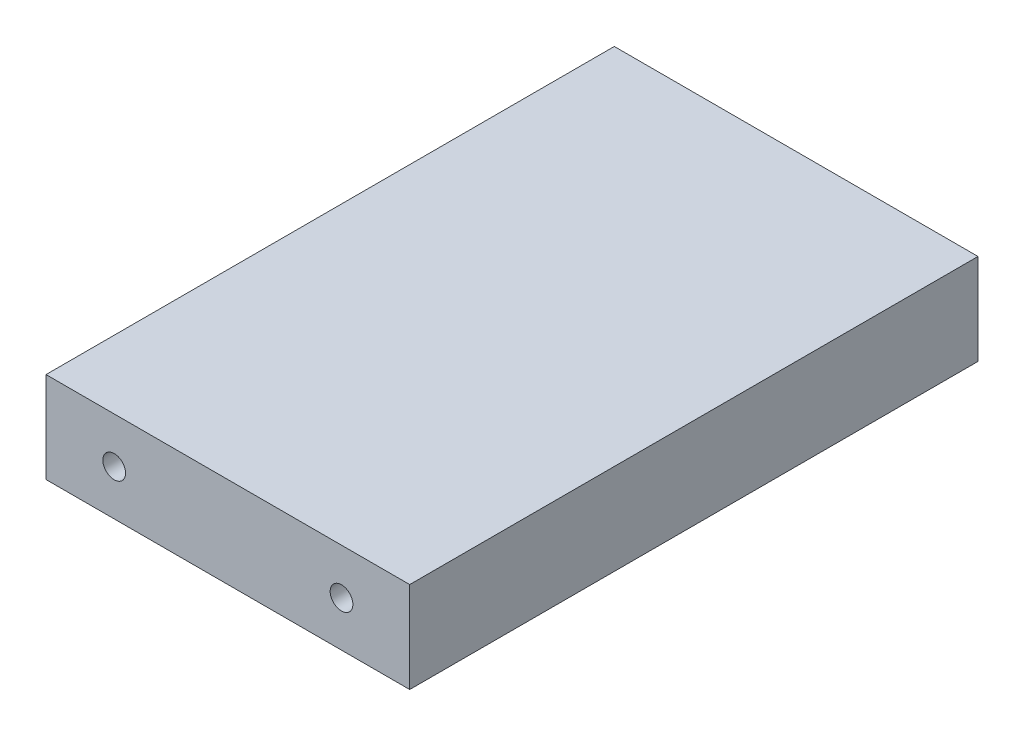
ISO-10303-21;
HEADER;
FILE_DESCRIPTION(('STEP AP214'),'2;1');
FILE_NAME('part.step','',(''),(''),'','','');
FILE_SCHEMA(('AUTOMOTIVE_DESIGN { 1 0 10303 214 1 1 1 1 }'));
ENDSEC;
DATA;
#1=APPLICATION_CONTEXT('core data for automotive mechanical design processes');
#2=APPLICATION_PROTOCOL_DEFINITION('international standard','automotive_design',2000,#1);
#3=PRODUCT_CONTEXT('',#1,'mechanical');
#4=PRODUCT('Part','Part','',(#3));
#5=PRODUCT_RELATED_PRODUCT_CATEGORY('part','',(#4));
#6=PRODUCT_DEFINITION_FORMATION('','',#4);
#7=PRODUCT_DEFINITION_CONTEXT('part definition',#1,'design');
#8=PRODUCT_DEFINITION('design','',#6,#7);
#9=PRODUCT_DEFINITION_SHAPE('','',#8);
#10=(LENGTH_UNIT() NAMED_UNIT(*) SI_UNIT(.MILLI.,.METRE.));
#11=(NAMED_UNIT(*) PLANE_ANGLE_UNIT() SI_UNIT($,.RADIAN.));
#12=(NAMED_UNIT(*) SI_UNIT($,.STERADIAN.) SOLID_ANGLE_UNIT());
#13=UNCERTAINTY_MEASURE_WITH_UNIT(LENGTH_MEASURE(1.E-05),#10,'distance_accuracy_value','');
#14=(GEOMETRIC_REPRESENTATION_CONTEXT(3) GLOBAL_UNCERTAINTY_ASSIGNED_CONTEXT((#13)) GLOBAL_UNIT_ASSIGNED_CONTEXT((#10,
#11,#12)) REPRESENTATION_CONTEXT('',''));
#15=CARTESIAN_POINT('',(0.,0.,0.));
#16=DIRECTION('',(0.,0.,1.));
#17=DIRECTION('',(1.,0.,0.));
#18=AXIS2_PLACEMENT_3D('',#15,#16,#17);
#19=CARTESIAN_POINT('',(0.,0.,125.));
#20=DIRECTION('',(-1.,0.,0.));
#21=DIRECTION('',(0.,0.,1.));
#22=AXIS2_PLACEMENT_3D('',#19,#20,#21);
#23=PLANE('',#22);
#24=DIRECTION('',(0.,1.,0.));
#25=VECTOR('',#24,1.);
#26=CARTESIAN_POINT('',(0.,0.,0.));
#27=LINE('',#26,#25);
#28=CARTESIAN_POINT('',(0.,0.,0.));
#29=VERTEX_POINT('',#28);
#30=CARTESIAN_POINT('',(0.,20.,0.));
#31=VERTEX_POINT('',#30);
#32=EDGE_CURVE('E114',#29,#31,#27,.T.);
#33=ORIENTED_EDGE('',*,*,#32,.T.);
#34=DIRECTION('',(0.,0.,-1.));
#35=VECTOR('',#34,1.);
#36=CARTESIAN_POINT('',(0.,20.,125.));
#37=LINE('',#36,#35);
#38=CARTESIAN_POINT('',(0.,20.,125.));
#39=VERTEX_POINT('',#38);
#40=EDGE_CURVE('E11',#39,#31,#37,.T.);
#41=ORIENTED_EDGE('',*,*,#40,.F.);
#42=DIRECTION('',(0.,1.,0.));
#43=VECTOR('',#42,1.);
#44=CARTESIAN_POINT('',(0.,0.,125.));
#45=LINE('',#44,#43);
#46=CARTESIAN_POINT('',(0.,0.,125.));
#47=VERTEX_POINT('',#46);
#48=EDGE_CURVE('E115',#47,#39,#45,.T.);
#49=ORIENTED_EDGE('',*,*,#48,.F.);
#50=DIRECTION('',(0.,0.,-1.));
#51=VECTOR('',#50,1.);
#52=CARTESIAN_POINT('',(0.,0.,125.));
#53=LINE('',#52,#51);
#54=EDGE_CURVE('E121',#47,#29,#53,.T.);
#55=ORIENTED_EDGE('',*,*,#54,.T.);
#56=EDGE_LOOP('',(#33,#41,#49,#55));
#57=FACE_BOUND('',#56,.T.);
#58=ADVANCED_FACE('F39',(#57),#23,.F.);
#59=CARTESIAN_POINT('',(0.,20.,125.));
#60=DIRECTION('',(0.,-1.,0.));
#61=DIRECTION('',(1.,0.,0.));
#62=AXIS2_PLACEMENT_3D('',#59,#60,#61);
#63=PLANE('',#62);
#64=DIRECTION('',(-1.,0.,0.));
#65=VECTOR('',#64,1.);
#66=CARTESIAN_POINT('',(0.,20.,0.));
#67=LINE('',#66,#65);
#68=CARTESIAN_POINT('',(-80.,20.,0.));
#69=VERTEX_POINT('',#68);
#70=EDGE_CURVE('E124',#31,#69,#67,.T.);
#71=ORIENTED_EDGE('',*,*,#70,.T.);
#72=DIRECTION('',(0.,0.,-1.));
#73=VECTOR('',#72,1.);
#74=CARTESIAN_POINT('',(-80.,20.,125.));
#75=LINE('',#74,#73);
#76=CARTESIAN_POINT('',(-80.,20.,125.));
#77=VERTEX_POINT('',#76);
#78=EDGE_CURVE('E47',#77,#69,#75,.T.);
#79=ORIENTED_EDGE('',*,*,#78,.F.);
#80=DIRECTION('',(-1.,0.,0.));
#81=VECTOR('',#80,1.);
#82=CARTESIAN_POINT('',(0.,20.,125.));
#83=LINE('',#82,#81);
#84=EDGE_CURVE('E86',#39,#77,#83,.T.);
#85=ORIENTED_EDGE('',*,*,#84,.F.);
#86=ORIENTED_EDGE('',*,*,#40,.T.);
#87=EDGE_LOOP('',(#71,#79,#85,#86));
#88=FACE_BOUND('',#87,.T.);
#89=ADVANCED_FACE('F148',(#88),#63,.F.);
#90=CARTESIAN_POINT('',(-80.,0.,125.));
#91=DIRECTION('',(1.,0.,0.));
#92=DIRECTION('',(0.,0.,-1.));
#93=AXIS2_PLACEMENT_3D('',#90,#91,#92);
#94=PLANE('',#93);
#95=DIRECTION('',(0.,-1.,0.));
#96=VECTOR('',#95,1.);
#97=CARTESIAN_POINT('',(-80.,0.,0.));
#98=LINE('',#97,#96);
#99=CARTESIAN_POINT('',(-80.,0.,0.));
#100=VERTEX_POINT('',#99);
#101=EDGE_CURVE('E73',#69,#100,#98,.T.);
#102=ORIENTED_EDGE('',*,*,#101,.T.);
#103=DIRECTION('',(0.,0.,-1.));
#104=VECTOR('',#103,1.);
#105=CARTESIAN_POINT('',(-80.,0.,125.));
#106=LINE('',#105,#104);
#107=CARTESIAN_POINT('',(-80.,0.,125.));
#108=VERTEX_POINT('',#107);
#109=EDGE_CURVE('E129',#108,#100,#106,.T.);
#110=ORIENTED_EDGE('',*,*,#109,.F.);
#111=DIRECTION('',(0.,-1.,0.));
#112=VECTOR('',#111,1.);
#113=CARTESIAN_POINT('',(-80.,0.,125.));
#114=LINE('',#113,#112);
#115=EDGE_CURVE('E118',#77,#108,#114,.T.);
#116=ORIENTED_EDGE('',*,*,#115,.F.);
#117=ORIENTED_EDGE('',*,*,#78,.T.);
#118=EDGE_LOOP('',(#102,#110,#116,#117));
#119=FACE_BOUND('',#118,.T.);
#120=ADVANCED_FACE('F131',(#119),#94,.F.);
#121=CARTESIAN_POINT('',(0.,0.,125.));
#122=DIRECTION('',(0.,1.,0.));
#123=DIRECTION('',(-1.,0.,0.));
#124=AXIS2_PLACEMENT_3D('',#121,#122,#123);
#125=PLANE('',#124);
#126=DIRECTION('',(1.,0.,0.));
#127=VECTOR('',#126,1.);
#128=CARTESIAN_POINT('',(0.,0.,0.));
#129=LINE('',#128,#127);
#130=EDGE_CURVE('E79',#100,#29,#129,.T.);
#131=ORIENTED_EDGE('',*,*,#130,.T.);
#132=ORIENTED_EDGE('',*,*,#54,.F.);
#133=DIRECTION('',(1.,0.,0.));
#134=VECTOR('',#133,1.);
#135=CARTESIAN_POINT('',(0.,0.,125.));
#136=LINE('',#135,#134);
#137=EDGE_CURVE('E55',#108,#47,#136,.T.);
#138=ORIENTED_EDGE('',*,*,#137,.F.);
#139=ORIENTED_EDGE('',*,*,#109,.T.);
#140=EDGE_LOOP('',(#131,#132,#138,#139));
#141=FACE_BOUND('',#140,.T.);
#142=ADVANCED_FACE('F138',(#141),#125,.F.);
#143=CARTESIAN_POINT('',(0.,0.,125.));
#144=DIRECTION('',(0.,0.,1.));
#145=DIRECTION('',(1.,0.,0.));
#146=AXIS2_PLACEMENT_3D('',#143,#144,#145);
#147=PLANE('',#146);
#148=CARTESIAN_POINT('',(-65.,9.9586469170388,125.));
#149=DIRECTION('',(0.,0.,1.));
#150=DIRECTION('',(1.,0.,0.));
#151=AXIS2_PLACEMENT_3D('',#148,#149,#150);
#152=CIRCLE('',#151,2.49999999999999);
#153=CARTESIAN_POINT('',(-62.5,9.9586469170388,125.));
#154=VERTEX_POINT('',#153);
#155=EDGE_CURVE('E104',#154,#154,#152,.T.);
#156=ORIENTED_EDGE('',*,*,#155,.F.);
#157=EDGE_LOOP('',(#156));
#158=FACE_BOUND('',#157,.T.);
#159=CARTESIAN_POINT('',(-15.,9.9586469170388,125.));
#160=DIRECTION('',(0.,0.,1.));
#161=DIRECTION('',(1.,0.,0.));
#162=AXIS2_PLACEMENT_3D('',#159,#160,#161);
#163=CIRCLE('',#162,2.49999999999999);
#164=CARTESIAN_POINT('',(-12.5,9.9586469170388,125.));
#165=VERTEX_POINT('',#164);
#166=EDGE_CURVE('E103',#165,#165,#163,.T.);
#167=ORIENTED_EDGE('',*,*,#166,.F.);
#168=EDGE_LOOP('',(#167));
#169=FACE_BOUND('',#168,.T.);
#170=ORIENTED_EDGE('',*,*,#48,.T.);
#171=ORIENTED_EDGE('',*,*,#84,.T.);
#172=ORIENTED_EDGE('',*,*,#115,.T.);
#173=ORIENTED_EDGE('',*,*,#137,.T.);
#174=EDGE_LOOP('',(#170,#171,#172,#173));
#175=FACE_BOUND('',#174,.T.);
#176=ADVANCED_FACE('F140',(#158,#169,#175),#147,.T.);
#177=CARTESIAN_POINT('',(0.,0.,0.));
#178=DIRECTION('',(0.,0.,1.));
#179=DIRECTION('',(1.,0.,0.));
#180=AXIS2_PLACEMENT_3D('',#177,#178,#179);
#181=PLANE('',#180);
#182=ORIENTED_EDGE('',*,*,#32,.F.);
#183=ORIENTED_EDGE('',*,*,#130,.F.);
#184=ORIENTED_EDGE('',*,*,#101,.F.);
#185=ORIENTED_EDGE('',*,*,#70,.F.);
#186=EDGE_LOOP('',(#182,#183,#184,#185));
#187=FACE_BOUND('',#186,.T.);
#188=ADVANCED_FACE('F134',(#187),#181,.F.);
#189=CARTESIAN_POINT('',(-15.,9.9586469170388,98.));
#190=DIRECTION('',(0.,0.,1.));
#191=DIRECTION('',(1.,0.,0.));
#192=AXIS2_PLACEMENT_3D('',#189,#190,#191);
#193=CONICAL_SURFACE('',#192,2.5,1.02974425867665);
#194=CARTESIAN_POINT('',(-15.,9.9586469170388,96.4978484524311));
#195=VERTEX_POINT('',#194);
#196=VERTEX_LOOP('',#195);
#197=FACE_BOUND('',#196,.T.);
#198=CARTESIAN_POINT('',(-15.,9.9586469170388,98.));
#199=DIRECTION('',(0.,0.,1.));
#200=DIRECTION('',(1.,0.,0.));
#201=AXIS2_PLACEMENT_3D('',#198,#199,#200);
#202=CIRCLE('',#201,2.5);
#203=CARTESIAN_POINT('',(-12.5,9.9586469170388,98.));
#204=VERTEX_POINT('',#203);
#205=EDGE_CURVE('E107',#204,#204,#202,.T.);
#206=ORIENTED_EDGE('',*,*,#205,.T.);
#207=EDGE_LOOP('',(#206));
#208=FACE_BOUND('',#207,.T.);
#209=ADVANCED_FACE('F175',(#197,#208),#193,.F.);
#210=CARTESIAN_POINT('',(-15.,9.9586469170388,125.));
#211=DIRECTION('',(0.,0.,1.));
#212=DIRECTION('',(1.,0.,0.));
#213=AXIS2_PLACEMENT_3D('',#210,#211,#212);
#214=CYLINDRICAL_SURFACE('',#213,2.49999999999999);
#215=ORIENTED_EDGE('',*,*,#205,.F.);
#216=EDGE_LOOP('',(#215));
#217=FACE_BOUND('',#216,.T.);
#218=ORIENTED_EDGE('',*,*,#166,.T.);
#219=EDGE_LOOP('',(#218));
#220=FACE_BOUND('',#219,.T.);
#221=ADVANCED_FACE('F97',(#217,#220),#214,.F.);
#222=CARTESIAN_POINT('',(-65.,9.9586469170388,98.));
#223=DIRECTION('',(0.,0.,1.));
#224=DIRECTION('',(1.,0.,0.));
#225=AXIS2_PLACEMENT_3D('',#222,#223,#224);
#226=CONICAL_SURFACE('',#225,2.49999999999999,1.02974425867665);
#227=CARTESIAN_POINT('',(-65.,9.9586469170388,96.4978484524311));
#228=VERTEX_POINT('',#227);
#229=VERTEX_LOOP('',#228);
#230=FACE_BOUND('',#229,.T.);
#231=CARTESIAN_POINT('',(-65.,9.9586469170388,98.));
#232=DIRECTION('',(0.,0.,1.));
#233=DIRECTION('',(1.,0.,0.));
#234=AXIS2_PLACEMENT_3D('',#231,#232,#233);
#235=CIRCLE('',#234,2.49999999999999);
#236=CARTESIAN_POINT('',(-62.5,9.9586469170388,98.));
#237=VERTEX_POINT('',#236);
#238=EDGE_CURVE('E101',#237,#237,#235,.T.);
#239=ORIENTED_EDGE('',*,*,#238,.T.);
#240=EDGE_LOOP('',(#239));
#241=FACE_BOUND('',#240,.T.);
#242=ADVANCED_FACE('F93',(#230,#241),#226,.F.);
#243=CARTESIAN_POINT('',(-65.,9.9586469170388,125.));
#244=DIRECTION('',(0.,0.,1.));
#245=DIRECTION('',(1.,0.,0.));
#246=AXIS2_PLACEMENT_3D('',#243,#244,#245);
#247=CYLINDRICAL_SURFACE('',#246,2.49999999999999);
#248=ORIENTED_EDGE('',*,*,#238,.F.);
#249=EDGE_LOOP('',(#248));
#250=FACE_BOUND('',#249,.T.);
#251=ORIENTED_EDGE('',*,*,#155,.T.);
#252=EDGE_LOOP('',(#251));
#253=FACE_BOUND('',#252,.T.);
#254=ADVANCED_FACE('F96',(#250,#253),#247,.F.);
#255=CLOSED_SHELL('',(#58,#89,#120,#142,#176,#188,#209,#221,#242,#254));
#256=MANIFOLD_SOLID_BREP('B2',#255);
#257=ADVANCED_BREP_SHAPE_REPRESENTATION('',(#18,#256),#14);
#258=SHAPE_DEFINITION_REPRESENTATION(#9,#257);
ENDSEC;
END-ISO-10303-21;
